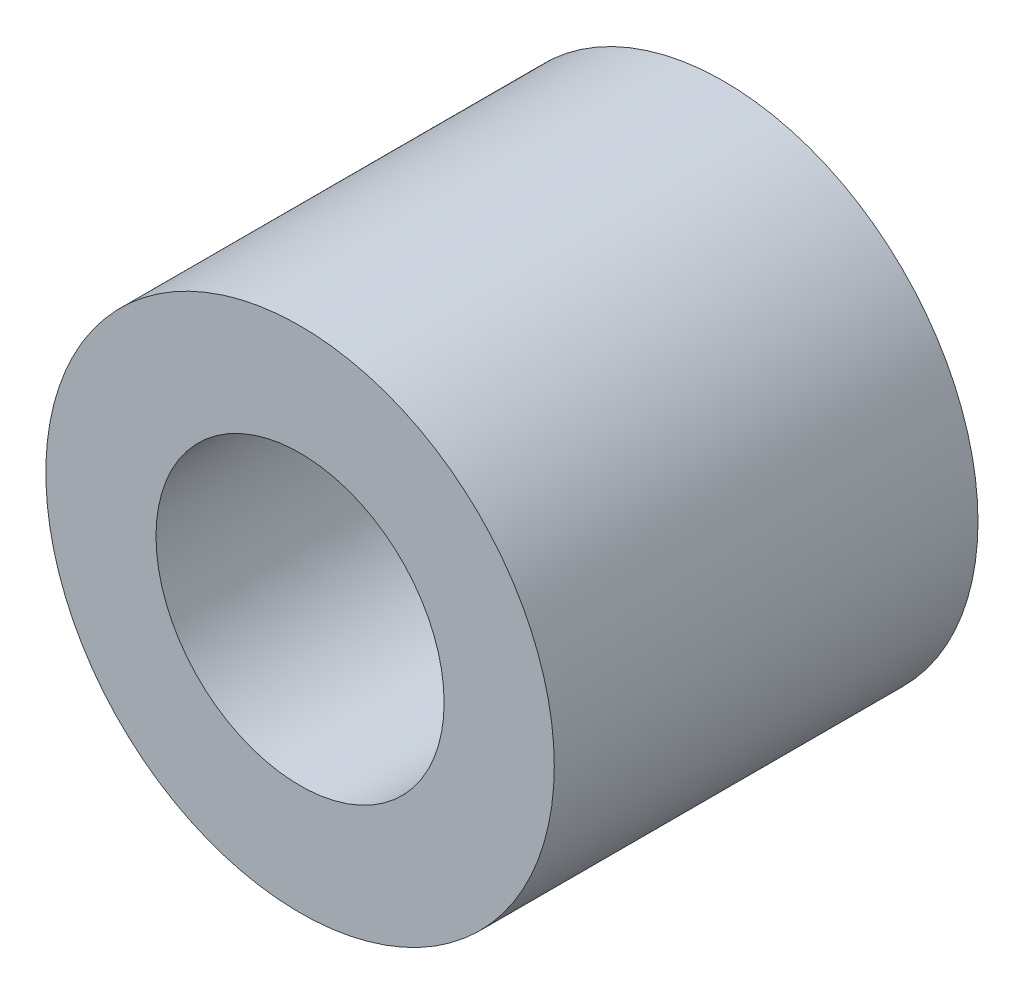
from build123d import *

# Parameters (mm, degrees)
SKETCH_1_R                    = 3
SKETCH_1_R_2                  = 1.7
M3_CLEARANCE_SLEEVE_5MM_DEPTH = 5


with BuildPart() as part:
    # Sketch 1 → M3_clearance_sleeve_5mm (new body)
    with BuildSketch(Plane.XY):
        Circle(SKETCH_1_R)
        Circle(SKETCH_1_R_2, mode=Mode.SUBTRACT)
    extrude(amount=M3_CLEARANCE_SLEEVE_5MM_DEPTH)


solid = part.part
